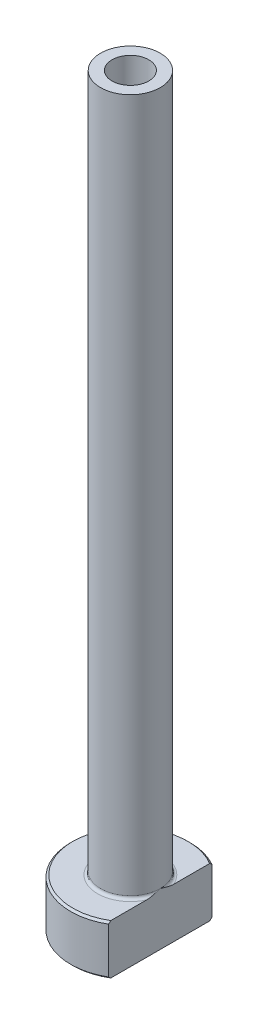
from build123d import *

# Parameters (mm, degrees)
FILLET1_R          = 0.3
CHAMFER1_SIZE      = 0.2
CUT_EXTRUDE1_DEPTH = 76.478473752
CHAMFER2_SIZE      = 0.5


with BuildPart() as part:
    # Sketch1 → Revolve1 (revolve)
    with BuildSketch(Plane.XY, mode=Mode.PRIVATE) as revolve1_sk:
        Polygon((-1.85, 75), (-3, 75), (-3, 5), (-6, 5), (-6, 0), (-2.1, 0), (-2.1, 18), (-1.85, 30), align=None)
    revolve(revolve1_sk.sketch.rotate(Axis((0, 92.187680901, 0), (0, -1, 0)), 270), axis=Axis((0, 92.187680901, 0), (0, -1, 0)))

    # Fillet1
    fillet1_edges = [part.edges().sort_by_distance(p)[0] for p in [
        (0, 5, -3),
    ]]
    fillet(fillet1_edges, radius=FILLET1_R)

    # Chamfer1
    chamfer1_edges = [part.edges().sort_by_distance(p)[0] for p in [
        (0, 0, -6),
        (0, 5, -6),
    ]]
    chamfer(chamfer1_edges, length=CHAMFER1_SIZE)

    # Sketch2 → Cut-Extrude1 (cut, through all)
    with BuildSketch(Plane.XZ):
        with BuildLine():
            Line((3, 5.196152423), (3, -5.196152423))
            ThreePointArc((3, -5.196152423), (6, 0), (3, 5.196152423))
        make_face()
    extrude(amount=-CUT_EXTRUDE1_DEPTH, mode=Mode.SUBTRACT)

    # Chamfer2
    chamfer2_edges = [part.edges().sort_by_distance(p)[0] for p in [
        (0, 0, -2.1),
    ]]
    chamfer(chamfer2_edges, length=CHAMFER2_SIZE)


solid = part.part
